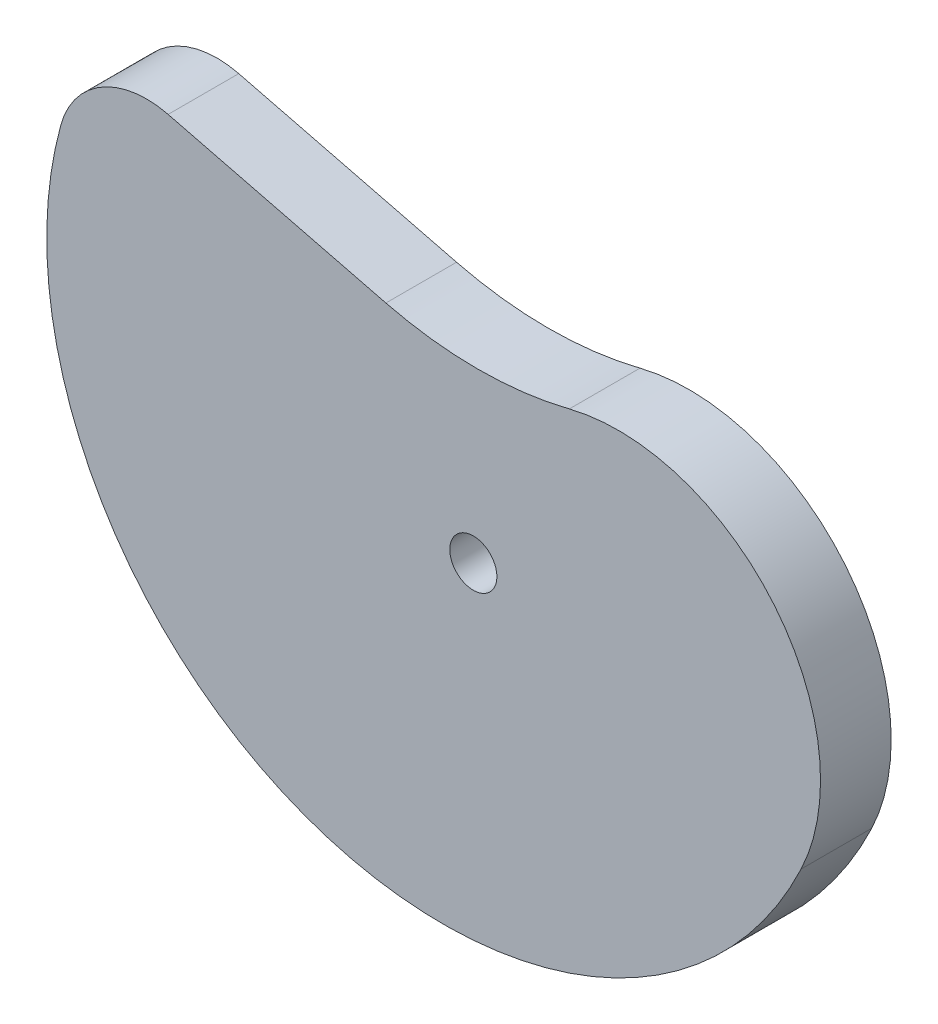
ISO-10303-21;
HEADER;
FILE_DESCRIPTION(('STEP AP214'),'2;1');
FILE_NAME('part.step','',(''),(''),'','','');
FILE_SCHEMA(('AUTOMOTIVE_DESIGN { 1 0 10303 214 1 1 1 1 }'));
ENDSEC;
DATA;
#1=APPLICATION_CONTEXT('core data for automotive mechanical design processes');
#2=APPLICATION_PROTOCOL_DEFINITION('international standard','automotive_design',2000,#1);
#3=PRODUCT_CONTEXT('',#1,'mechanical');
#4=PRODUCT('Part','Part','',(#3));
#5=PRODUCT_RELATED_PRODUCT_CATEGORY('part','',(#4));
#6=PRODUCT_DEFINITION_FORMATION('','',#4);
#7=PRODUCT_DEFINITION_CONTEXT('part definition',#1,'design');
#8=PRODUCT_DEFINITION('design','',#6,#7);
#9=PRODUCT_DEFINITION_SHAPE('','',#8);
#10=(LENGTH_UNIT() NAMED_UNIT(*) SI_UNIT(.MILLI.,.METRE.));
#11=(NAMED_UNIT(*) PLANE_ANGLE_UNIT() SI_UNIT($,.RADIAN.));
#12=(NAMED_UNIT(*) SI_UNIT($,.STERADIAN.) SOLID_ANGLE_UNIT());
#13=UNCERTAINTY_MEASURE_WITH_UNIT(LENGTH_MEASURE(1.E-05),#10,'distance_accuracy_value','');
#14=(GEOMETRIC_REPRESENTATION_CONTEXT(3) GLOBAL_UNCERTAINTY_ASSIGNED_CONTEXT((#13)) GLOBAL_UNIT_ASSIGNED_CONTEXT((#10,
#11,#12)) REPRESENTATION_CONTEXT('',''));
#15=CARTESIAN_POINT('',(0.,0.,0.));
#16=DIRECTION('',(0.,0.,1.));
#17=DIRECTION('',(1.,0.,0.));
#18=AXIS2_PLACEMENT_3D('',#15,#16,#17);
#19=CARTESIAN_POINT('',(0.,0.,19.05));
#20=DIRECTION('',(0.,0.,1.));
#21=DIRECTION('',(1.,0.,0.));
#22=AXIS2_PLACEMENT_3D('',#19,#20,#21);
#23=PLANE('',#22);
#24=CARTESIAN_POINT('',(0.,0.,19.05));
#25=DIRECTION('',(0.,0.,1.));
#26=DIRECTION('',(1.,0.,0.));
#27=AXIS2_PLACEMENT_3D('',#24,#25,#26);
#28=CIRCLE('',#27,6.35);
#29=CARTESIAN_POINT('',(-6.35,0.,19.05));
#30=VERTEX_POINT('',#29);
#31=EDGE_CURVE('E11',#30,#30,#28,.T.);
#32=ORIENTED_EDGE('',*,*,#31,.F.);
#33=EDGE_LOOP('',(#32));
#34=FACE_BOUND('',#33,.T.);
#35=CARTESIAN_POINT('',(-88.1175060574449,40.3813918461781,19.05));
#36=DIRECTION('',(0.,0.,1.));
#37=DIRECTION('',(-1.,0.,0.));
#38=AXIS2_PLACEMENT_3D('',#35,#36,#37);
#39=CIRCLE('',#38,23.9610285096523);
#40=CARTESIAN_POINT('',(-82.3061030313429,63.6270039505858,19.05));
#41=VERTEX_POINT('',#40);
#42=CARTESIAN_POINT('',(-111.224570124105,46.7213033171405,19.05));
#43=VERTEX_POINT('',#42);
#44=EDGE_CURVE('E74',#41,#43,#39,.T.);
#45=ORIENTED_EDGE('',*,*,#44,.T.);
#46=CARTESIAN_POINT('',(-8.18706275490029,18.4507851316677,19.05));
#47=DIRECTION('',(0.,0.,1.));
#48=DIRECTION('',(-1.,0.,0.));
#49=AXIS2_PLACEMENT_3D('',#46,#47,#48);
#50=CIRCLE('',#49,106.845449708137);
#51=CARTESIAN_POINT('',(88.3832062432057,-27.2671902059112,19.05));
#52=VERTEX_POINT('',#51);
#53=EDGE_CURVE('E83',#43,#52,#50,.T.);
#54=ORIENTED_EDGE('',*,*,#53,.T.);
#55=CARTESIAN_POINT('',(39.11150554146,-3.94114564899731,19.05));
#56=DIRECTION('',(0.,0.,1.));
#57=DIRECTION('',(-1.,0.,0.));
#58=AXIS2_PLACEMENT_3D('',#55,#56,#57);
#59=CIRCLE('',#58,54.5142627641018);
#60=CARTESIAN_POINT('',(25.8898547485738,48.945457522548,19.05));
#61=VERTEX_POINT('',#60);
#62=EDGE_CURVE('E89',#52,#61,#59,.T.);
#63=ORIENTED_EDGE('',*,*,#62,.T.);
#64=CARTESIAN_POINT('',(1.15496871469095,147.885001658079,19.05));
#65=DIRECTION('',(0.,0.,-1.));
#66=DIRECTION('',(1.,0.,0.));
#67=AXIS2_PLACEMENT_3D('',#64,#65,#66);
#68=CIRCLE('',#67,101.984547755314);
#69=CARTESIAN_POINT('',(-23.579917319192,48.945457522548,19.05));
#70=VERTEX_POINT('',#69);
#71=EDGE_CURVE('E98',#61,#70,#68,.T.);
#72=ORIENTED_EDGE('',*,*,#71,.T.);
#73=DIRECTION('',(-0.970142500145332,0.242535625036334,0.));
#74=VECTOR('',#73,1.);
#75=CARTESIAN_POINT('',(-82.3061030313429,63.6270039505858,19.05));
#76=LINE('',#75,#74);
#77=EDGE_CURVE('E80',#70,#41,#76,.T.);
#78=ORIENTED_EDGE('',*,*,#77,.T.);
#79=EDGE_LOOP('',(#45,#54,#63,#72,#78));
#80=FACE_BOUND('',#79,.T.);
#81=ADVANCED_FACE('F27',(#34,#80),#23,.T.);
#82=CARTESIAN_POINT('',(0.,0.,0.));
#83=DIRECTION('',(0.,0.,1.));
#84=DIRECTION('',(1.,0.,0.));
#85=AXIS2_PLACEMENT_3D('',#82,#83,#84);
#86=PLANE('',#85);
#87=CARTESIAN_POINT('',(0.,0.,0.));
#88=DIRECTION('',(0.,0.,1.));
#89=DIRECTION('',(1.,0.,0.));
#90=AXIS2_PLACEMENT_3D('',#87,#88,#89);
#91=CIRCLE('',#90,6.35);
#92=CARTESIAN_POINT('',(-6.35,0.,0.));
#93=VERTEX_POINT('',#92);
#94=EDGE_CURVE('E35',#93,#93,#91,.T.);
#95=ORIENTED_EDGE('',*,*,#94,.T.);
#96=EDGE_LOOP('',(#95));
#97=FACE_BOUND('',#96,.T.);
#98=CARTESIAN_POINT('',(-88.1175060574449,40.3813918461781,0.));
#99=DIRECTION('',(0.,0.,1.));
#100=DIRECTION('',(1.,0.,0.));
#101=AXIS2_PLACEMENT_3D('',#98,#99,#100);
#102=CIRCLE('',#101,23.9610285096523);
#103=CARTESIAN_POINT('',(-111.224570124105,46.7213033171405,0.));
#104=VERTEX_POINT('',#103);
#105=CARTESIAN_POINT('',(-82.3061030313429,63.6270039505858,0.));
#106=VERTEX_POINT('',#105);
#107=EDGE_CURVE('E76',#104,#106,#102,.F.);
#108=ORIENTED_EDGE('',*,*,#107,.T.);
#109=DIRECTION('',(0.970142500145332,-0.242535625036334,0.));
#110=VECTOR('',#109,1.);
#111=CARTESIAN_POINT('',(-82.3061030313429,63.6270039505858,0.));
#112=LINE('',#111,#110);
#113=CARTESIAN_POINT('',(-23.579917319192,48.945457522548,0.));
#114=VERTEX_POINT('',#113);
#115=EDGE_CURVE('E114',#106,#114,#112,.T.);
#116=ORIENTED_EDGE('',*,*,#115,.T.);
#117=CARTESIAN_POINT('',(1.15496871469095,147.885001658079,0.));
#118=DIRECTION('',(0.,0.,1.));
#119=DIRECTION('',(1.,0.,0.));
#120=AXIS2_PLACEMENT_3D('',#117,#118,#119);
#121=CIRCLE('',#120,101.984547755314);
#122=CARTESIAN_POINT('',(25.8898547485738,48.9454575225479,0.));
#123=VERTEX_POINT('',#122);
#124=EDGE_CURVE('E42',#114,#123,#121,.T.);
#125=ORIENTED_EDGE('',*,*,#124,.T.);
#126=CARTESIAN_POINT('',(39.11150554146,-3.94114564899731,0.));
#127=DIRECTION('',(0.,0.,1.));
#128=DIRECTION('',(1.,0.,0.));
#129=AXIS2_PLACEMENT_3D('',#126,#127,#128);
#130=CIRCLE('',#129,54.5142627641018);
#131=CARTESIAN_POINT('',(88.3832062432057,-27.2671902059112,0.));
#132=VERTEX_POINT('',#131);
#133=EDGE_CURVE('E103',#123,#132,#130,.F.);
#134=ORIENTED_EDGE('',*,*,#133,.T.);
#135=CARTESIAN_POINT('',(-8.18706275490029,18.4507851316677,0.));
#136=DIRECTION('',(0.,0.,1.));
#137=DIRECTION('',(1.,0.,0.));
#138=AXIS2_PLACEMENT_3D('',#135,#136,#137);
#139=CIRCLE('',#138,106.845449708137);
#140=EDGE_CURVE('E109',#132,#104,#139,.F.);
#141=ORIENTED_EDGE('',*,*,#140,.T.);
#142=EDGE_LOOP('',(#108,#116,#125,#134,#141));
#143=FACE_BOUND('',#142,.T.);
#144=ADVANCED_FACE('F118',(#97,#143),#86,.F.);
#145=CARTESIAN_POINT('',(0.,0.,19.05));
#146=DIRECTION('',(0.,0.,-1.));
#147=DIRECTION('',(-1.,0.,0.));
#148=AXIS2_PLACEMENT_3D('',#145,#146,#147);
#149=CYLINDRICAL_SURFACE('',#148,6.35);
#150=CARTESIAN_POINT('',(-6.35,0.,19.05));
#151=CARTESIAN_POINT('',(-6.35,0.,18.8515625));
#152=CARTESIAN_POINT('',(-6.35,0.,18.653125));
#153=CARTESIAN_POINT('',(-6.35,0.,18.25625));
#154=CARTESIAN_POINT('',(-6.35,0.,18.0578125));
#155=CARTESIAN_POINT('',(-6.35,0.,17.6609375));
#156=CARTESIAN_POINT('',(-6.35,0.,17.4625));
#157=CARTESIAN_POINT('',(-6.35,0.,17.065625));
#158=CARTESIAN_POINT('',(-6.35,0.,16.8671875));
#159=CARTESIAN_POINT('',(-6.35,0.,16.4703125));
#160=CARTESIAN_POINT('',(-6.35,0.,16.271875));
#161=CARTESIAN_POINT('',(-6.35,0.,15.875));
#162=CARTESIAN_POINT('',(-6.35,0.,15.6765625));
#163=CARTESIAN_POINT('',(-6.35,0.,15.2796875));
#164=CARTESIAN_POINT('',(-6.35,0.,15.08125));
#165=CARTESIAN_POINT('',(-6.35,0.,14.684375));
#166=CARTESIAN_POINT('',(-6.35,0.,14.4859375));
#167=CARTESIAN_POINT('',(-6.35,0.,14.0890625));
#168=CARTESIAN_POINT('',(-6.35,0.,13.890625));
#169=CARTESIAN_POINT('',(-6.35,0.,13.49375));
#170=CARTESIAN_POINT('',(-6.35,0.,13.2953125));
#171=CARTESIAN_POINT('',(-6.35,0.,12.8984375));
#172=CARTESIAN_POINT('',(-6.35,0.,12.7));
#173=CARTESIAN_POINT('',(-6.35,0.,12.303125));
#174=CARTESIAN_POINT('',(-6.35,0.,12.1046875));
#175=CARTESIAN_POINT('',(-6.35,0.,11.7078125));
#176=CARTESIAN_POINT('',(-6.35,0.,11.509375));
#177=CARTESIAN_POINT('',(-6.35,0.,11.1125));
#178=CARTESIAN_POINT('',(-6.35,0.,10.9140625));
#179=CARTESIAN_POINT('',(-6.35,0.,10.5171875));
#180=CARTESIAN_POINT('',(-6.35,0.,10.31875));
#181=CARTESIAN_POINT('',(-6.35,0.,9.921875));
#182=CARTESIAN_POINT('',(-6.35,0.,9.7234375));
#183=CARTESIAN_POINT('',(-6.35,0.,9.3265625));
#184=CARTESIAN_POINT('',(-6.35,0.,9.128125));
#185=CARTESIAN_POINT('',(-6.35,0.,8.73125));
#186=CARTESIAN_POINT('',(-6.35,0.,8.5328125));
#187=CARTESIAN_POINT('',(-6.35,0.,8.1359375));
#188=CARTESIAN_POINT('',(-6.35,0.,7.9375));
#189=CARTESIAN_POINT('',(-6.35,0.,7.540625));
#190=CARTESIAN_POINT('',(-6.35,0.,7.3421875));
#191=CARTESIAN_POINT('',(-6.35,0.,6.9453125));
#192=CARTESIAN_POINT('',(-6.35,0.,6.746875));
#193=CARTESIAN_POINT('',(-6.35,0.,6.35));
#194=CARTESIAN_POINT('',(-6.35,0.,6.1515625));
#195=CARTESIAN_POINT('',(-6.35,0.,5.7546875));
#196=CARTESIAN_POINT('',(-6.35,0.,5.55625));
#197=CARTESIAN_POINT('',(-6.35,0.,5.159375));
#198=CARTESIAN_POINT('',(-6.35,0.,4.9609375));
#199=CARTESIAN_POINT('',(-6.35,0.,4.5640625));
#200=CARTESIAN_POINT('',(-6.35,0.,4.365625));
#201=CARTESIAN_POINT('',(-6.35,0.,3.96875));
#202=CARTESIAN_POINT('',(-6.35,0.,3.7703125));
#203=CARTESIAN_POINT('',(-6.35,0.,3.3734375));
#204=CARTESIAN_POINT('',(-6.35,0.,3.175));
#205=CARTESIAN_POINT('',(-6.35,0.,2.778125));
#206=CARTESIAN_POINT('',(-6.35,0.,2.5796875));
#207=CARTESIAN_POINT('',(-6.35,0.,2.1828125));
#208=CARTESIAN_POINT('',(-6.35,0.,1.984375));
#209=CARTESIAN_POINT('',(-6.35,0.,1.5875));
#210=CARTESIAN_POINT('',(-6.35,0.,1.3890625));
#211=CARTESIAN_POINT('',(-6.35,0.,0.992187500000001));
#212=CARTESIAN_POINT('',(-6.35,0.,0.793750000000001));
#213=CARTESIAN_POINT('',(-6.35,0.,0.396875));
#214=CARTESIAN_POINT('',(-6.35,0.,0.1984375));
#215=CARTESIAN_POINT('',(-6.35,0.,0.));
#216=B_SPLINE_CURVE_WITH_KNOTS('',3,(#150,#151,#152,#153,#154,#155,#156,#157,#158,#159,#160,
#161,#162,#163,#164,#165,#166,#167,#168,#169,#170,#171,#172,#173,#174,#175,#176,#177,#178,#179,
#180,#181,#182,#183,#184,#185,#186,#187,#188,#189,#190,#191,#192,#193,#194,#195,#196,#197,#198,
#199,#200,#201,#202,#203,#204,#205,#206,#207,#208,#209,#210,#211,#212,#213,#214,#215),
.UNSPECIFIED.,.F.,.F.,(4,2,2,2,2,2,2,2,2,2,2,2,2,2,2,2,2,2,2,2,2,2,2,2,2,2,2,2,2,2,2,2,4),(0.,
0.5953125,1.190625,1.7859375,2.38125,2.9765625,3.571875,4.1671875,4.7625,5.3578125,5.953125,
6.5484375,7.14375,7.7390625,8.334375,8.9296875,9.525,10.1203125,10.715625,11.3109375,11.90625,
12.5015625,13.096875,13.6921875,14.2875,14.8828125,15.478125,16.0734375,16.66875,17.2640625,
17.859375,18.4546875,19.05),.UNSPECIFIED.);
#217=EDGE_CURVE('BSEAM141',#30,#93,#216,.T.);
#218=ORIENTED_EDGE('',*,*,#31,.T.);
#219=ORIENTED_EDGE('',*,*,#94,.F.);
#220=ORIENTED_EDGE('',*,*,#217,.T.);
#221=ORIENTED_EDGE('',*,*,#217,.F.);
#222=EDGE_LOOP('',(#218,#220,#219,#221));
#223=FACE_BOUND('',#222,.T.);
#224=ADVANCED_FACE('F141',(#223),#149,.F.);
#225=CARTESIAN_POINT('',(-8.18706275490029,18.4507851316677,-258.586340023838));
#226=DIRECTION('',(0.,0.,1.));
#227=DIRECTION('',(1.,0.,0.));
#228=AXIS2_PLACEMENT_3D('',#225,#226,#227);
#229=CYLINDRICAL_SURFACE('',#228,106.845449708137);
#230=ORIENTED_EDGE('',*,*,#140,.F.);
#231=DIRECTION('',(0.,0.,1.));
#232=VECTOR('',#231,1.);
#233=CARTESIAN_POINT('',(88.3832062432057,-27.2671902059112,-258.586340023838));
#234=LINE('',#233,#232);
#235=EDGE_CURVE('E79',#132,#52,#234,.T.);
#236=ORIENTED_EDGE('',*,*,#235,.T.);
#237=ORIENTED_EDGE('',*,*,#53,.F.);
#238=DIRECTION('',(0.,0.,1.));
#239=VECTOR('',#238,1.);
#240=CARTESIAN_POINT('',(-111.224570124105,46.7213033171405,-258.586340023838));
#241=LINE('',#240,#239);
#242=EDGE_CURVE('E69',#104,#43,#241,.T.);
#243=ORIENTED_EDGE('',*,*,#242,.F.);
#244=EDGE_LOOP('',(#230,#236,#237,#243));
#245=FACE_BOUND('',#244,.T.);
#246=ADVANCED_FACE('F84',(#245),#229,.T.);
#247=CARTESIAN_POINT('',(39.11150554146,-3.94114564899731,-258.586340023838));
#248=DIRECTION('',(0.,0.,1.));
#249=DIRECTION('',(1.,0.,0.));
#250=AXIS2_PLACEMENT_3D('',#247,#248,#249);
#251=CYLINDRICAL_SURFACE('',#250,54.5142627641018);
#252=ORIENTED_EDGE('',*,*,#133,.F.);
#253=DIRECTION('',(0.,0.,1.));
#254=VECTOR('',#253,1.);
#255=CARTESIAN_POINT('',(25.8898547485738,48.945457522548,-258.586340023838));
#256=LINE('',#255,#254);
#257=EDGE_CURVE('E106',#123,#61,#256,.T.);
#258=ORIENTED_EDGE('',*,*,#257,.T.);
#259=ORIENTED_EDGE('',*,*,#62,.F.);
#260=ORIENTED_EDGE('',*,*,#235,.F.);
#261=EDGE_LOOP('',(#252,#258,#259,#260));
#262=FACE_BOUND('',#261,.T.);
#263=ADVANCED_FACE('F133',(#262),#251,.T.);
#264=CARTESIAN_POINT('',(1.15496871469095,147.885001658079,-258.586340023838));
#265=DIRECTION('',(0.,0.,1.));
#266=DIRECTION('',(1.,0.,0.));
#267=AXIS2_PLACEMENT_3D('',#264,#265,#266);
#268=CYLINDRICAL_SURFACE('',#267,101.984547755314);
#269=ORIENTED_EDGE('',*,*,#124,.F.);
#270=DIRECTION('',(0.,0.,1.));
#271=VECTOR('',#270,1.);
#272=CARTESIAN_POINT('',(-23.579917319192,48.945457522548,-258.586340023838));
#273=LINE('',#272,#271);
#274=EDGE_CURVE('E104',#114,#70,#273,.T.);
#275=ORIENTED_EDGE('',*,*,#274,.T.);
#276=ORIENTED_EDGE('',*,*,#71,.F.);
#277=ORIENTED_EDGE('',*,*,#257,.F.);
#278=EDGE_LOOP('',(#269,#275,#276,#277));
#279=FACE_BOUND('',#278,.T.);
#280=ADVANCED_FACE('F123',(#279),#268,.F.);
#281=CARTESIAN_POINT('',(-82.3061030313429,63.6270039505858,-258.586340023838));
#282=DIRECTION('',(0.242535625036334,0.970142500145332,0.));
#283=DIRECTION('',(-0.970142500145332,0.242535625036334,0.));
#284=AXIS2_PLACEMENT_3D('',#281,#282,#283);
#285=PLANE('',#284);
#286=ORIENTED_EDGE('',*,*,#115,.F.);
#287=DIRECTION('',(0.,0.,1.));
#288=VECTOR('',#287,1.);
#289=CARTESIAN_POINT('',(-82.3061030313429,63.6270039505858,-258.586340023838));
#290=LINE('',#289,#288);
#291=EDGE_CURVE('E101',#106,#41,#290,.T.);
#292=ORIENTED_EDGE('',*,*,#291,.T.);
#293=ORIENTED_EDGE('',*,*,#77,.F.);
#294=ORIENTED_EDGE('',*,*,#274,.F.);
#295=EDGE_LOOP('',(#286,#292,#293,#294));
#296=FACE_BOUND('',#295,.T.);
#297=ADVANCED_FACE('F125',(#296),#285,.T.);
#298=CARTESIAN_POINT('',(-88.1175060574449,40.3813918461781,-258.586340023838));
#299=DIRECTION('',(0.,0.,1.));
#300=DIRECTION('',(1.,0.,0.));
#301=AXIS2_PLACEMENT_3D('',#298,#299,#300);
#302=CYLINDRICAL_SURFACE('',#301,23.9610285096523);
#303=ORIENTED_EDGE('',*,*,#107,.F.);
#304=ORIENTED_EDGE('',*,*,#242,.T.);
#305=ORIENTED_EDGE('',*,*,#44,.F.);
#306=ORIENTED_EDGE('',*,*,#291,.F.);
#307=EDGE_LOOP('',(#303,#304,#305,#306));
#308=FACE_BOUND('',#307,.T.);
#309=ADVANCED_FACE('F71',(#308),#302,.T.);
#310=CLOSED_SHELL('',(#81,#144,#224,#246,#263,#280,#297,#309));
#311=MANIFOLD_SOLID_BREP('B2',#310);
#312=ADVANCED_BREP_SHAPE_REPRESENTATION('',(#18,#311),#14);
#313=SHAPE_DEFINITION_REPRESENTATION(#9,#312);
ENDSEC;
END-ISO-10303-21;
